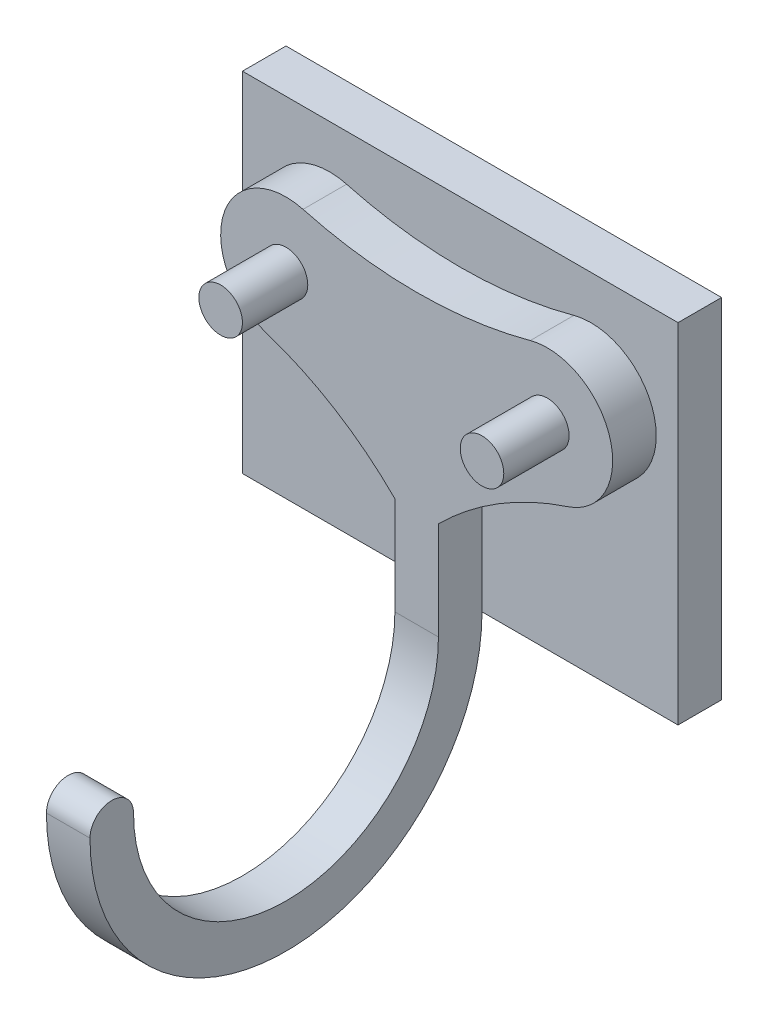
from build123d import *

# Parameters (mm, degrees)
CROQUIS1_W              = 20
CROQUIS1_H              = 16
SALIENTE_EXTRUIR1_DEPTH = 2
SALIENTE_EXTRUIR2_DEPTH = 2
CROQUIS3_R              = 1
SALIENTE_EXTRUIR3_DEPTH = 3
SALIENTE_EXTRUIR4_DEPTH = 2


with BuildPart() as part:
    # Croquis1 → Saliente-Extruir1 (new body)
    with BuildSketch(Plane.XY):
        Rectangle(CROQUIS1_W, CROQUIS1_H)
    extrude(amount=SALIENTE_EXTRUIR1_DEPTH)

    # Croquis2 → Saliente-Extruir2 (add)
    with BuildSketch(Plane.XY.offset(2)):
        with BuildLine():
            Line((-1, -3.5), (-1, -8))
            Line((-1, -8), (1, -8))
            Line((1, -8), (1, -3.5))
            ThreePointArc((1, -3.5), (3.752648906, -1.325939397), (6.934939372, 0.149405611))
            ThreePointArc((6.934939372, 0.149405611), (8.874367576, 3.859075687), (5.217391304, 5.896122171))
            ThreePointArc((5.217391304, 5.896122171), (0, 5.203603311), (-5.217391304, 5.896122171))
            ThreePointArc((-5.217391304, 5.896122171), (-8.874367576, 3.859075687), (-6.934939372, 0.149405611))
            ThreePointArc((-6.934939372, 0.149405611), (-3.752648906, -1.325939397), (-1, -3.5))
        make_face()
    extrude(amount=SALIENTE_EXTRUIR2_DEPTH)

    # Croquis3 → Saliente-Extruir3 (add)
    with BuildSketch(Plane.XY.offset(4)):
        with Locations((-6, 3)):
            Circle(CROQUIS3_R)
        with Locations((6, 3)):
            Circle(CROQUIS3_R)
    extrude(amount=SALIENTE_EXTRUIR3_DEPTH)

    # Croquis5 → Saliente-Extruir4 (add)
    with BuildSketch(Plane.ZY.offset(1)):
        with BuildLine():
            Line((4, -8), (2, -8))
            ThreePointArc((2, -8), (11, -17), (20, -8))
            ThreePointArc((20, -8), (19, -7), (18, -8))
            ThreePointArc((18, -8), (11, -15), (4, -8))
        make_face()
    extrude(amount=-SALIENTE_EXTRUIR4_DEPTH)


solid = part.part
